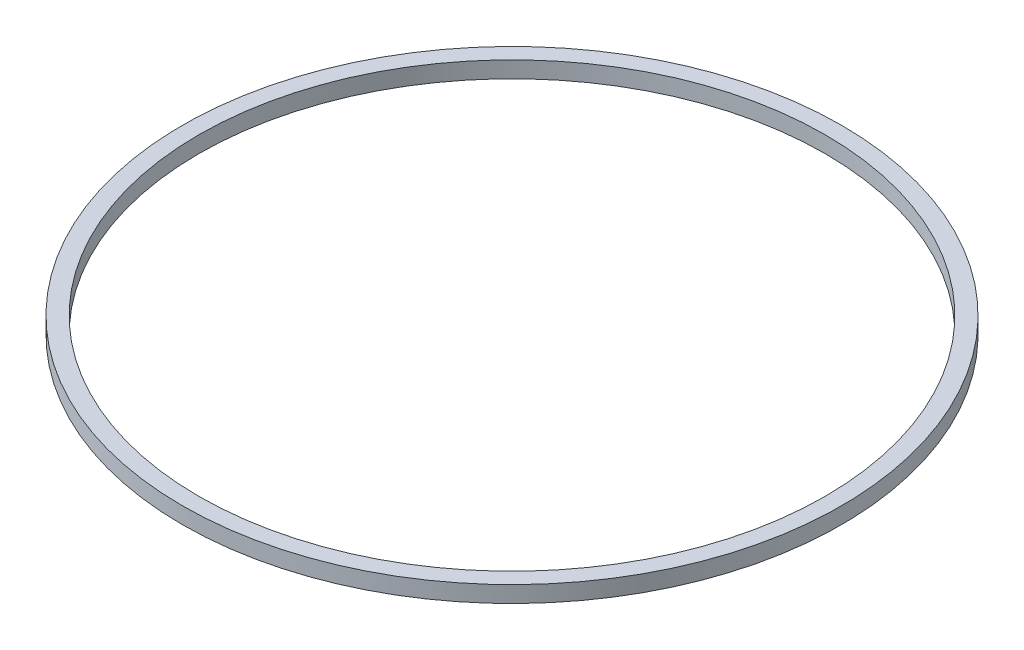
ISO-10303-21;
HEADER;
FILE_DESCRIPTION(('STEP AP214'),'2;1');
FILE_NAME('part.step','',(''),(''),'','','');
FILE_SCHEMA(('AUTOMOTIVE_DESIGN { 1 0 10303 214 1 1 1 1 }'));
ENDSEC;
DATA;
#1=APPLICATION_CONTEXT('core data for automotive mechanical design processes');
#2=APPLICATION_PROTOCOL_DEFINITION('international standard','automotive_design',2000,#1);
#3=PRODUCT_CONTEXT('',#1,'mechanical');
#4=PRODUCT('Part','Part','',(#3));
#5=PRODUCT_RELATED_PRODUCT_CATEGORY('part','',(#4));
#6=PRODUCT_DEFINITION_FORMATION('','',#4);
#7=PRODUCT_DEFINITION_CONTEXT('part definition',#1,'design');
#8=PRODUCT_DEFINITION('design','',#6,#7);
#9=PRODUCT_DEFINITION_SHAPE('','',#8);
#10=(LENGTH_UNIT() NAMED_UNIT(*) SI_UNIT(.MILLI.,.METRE.));
#11=(NAMED_UNIT(*) PLANE_ANGLE_UNIT() SI_UNIT($,.RADIAN.));
#12=(NAMED_UNIT(*) SI_UNIT($,.STERADIAN.) SOLID_ANGLE_UNIT());
#13=UNCERTAINTY_MEASURE_WITH_UNIT(LENGTH_MEASURE(1.E-05),#10,'distance_accuracy_value','');
#14=(GEOMETRIC_REPRESENTATION_CONTEXT(3) GLOBAL_UNCERTAINTY_ASSIGNED_CONTEXT((#13)) GLOBAL_UNIT_ASSIGNED_CONTEXT((#10,
#11,#12)) REPRESENTATION_CONTEXT('',''));
#15=CARTESIAN_POINT('',(0.,0.,0.));
#16=DIRECTION('',(0.,0.,1.));
#17=DIRECTION('',(1.,0.,0.));
#18=AXIS2_PLACEMENT_3D('',#15,#16,#17);
#19=CARTESIAN_POINT('',(0.,4.,0.));
#20=DIRECTION('',(0.,1.,0.));
#21=DIRECTION('',(0.,0.,1.));
#22=AXIS2_PLACEMENT_3D('',#19,#20,#21);
#23=PLANE('',#22);
#24=CARTESIAN_POINT('',(0.,4.,0.));
#25=DIRECTION('',(0.,1.,0.));
#26=DIRECTION('',(0.,0.,1.));
#27=AXIS2_PLACEMENT_3D('',#24,#25,#26);
#28=CIRCLE('',#27,80.4);
#29=CARTESIAN_POINT('',(0.,4.,80.4));
#30=VERTEX_POINT('',#29);
#31=EDGE_CURVE('E10',#30,#30,#28,.T.);
#32=ORIENTED_EDGE('',*,*,#31,.T.);
#33=EDGE_LOOP('',(#32));
#34=FACE_BOUND('',#33,.T.);
#35=CARTESIAN_POINT('',(0.,4.,0.));
#36=DIRECTION('',(0.,1.,0.));
#37=DIRECTION('',(0.,0.,1.));
#38=AXIS2_PLACEMENT_3D('',#35,#36,#37);
#39=CIRCLE('',#38,76.4);
#40=CARTESIAN_POINT('',(0.,4.,76.4));
#41=VERTEX_POINT('',#40);
#42=EDGE_CURVE('E46',#41,#41,#39,.T.);
#43=ORIENTED_EDGE('',*,*,#42,.F.);
#44=EDGE_LOOP('',(#43));
#45=FACE_BOUND('',#44,.T.);
#46=ADVANCED_FACE('F35',(#34,#45),#23,.T.);
#47=CARTESIAN_POINT('',(0.,0.,0.));
#48=DIRECTION('',(0.,1.,0.));
#49=DIRECTION('',(0.,0.,1.));
#50=AXIS2_PLACEMENT_3D('',#47,#48,#49);
#51=PLANE('',#50);
#52=CARTESIAN_POINT('',(0.,0.,0.));
#53=DIRECTION('',(0.,1.,0.));
#54=DIRECTION('',(0.,0.,1.));
#55=AXIS2_PLACEMENT_3D('',#52,#53,#54);
#56=CIRCLE('',#55,80.4);
#57=CARTESIAN_POINT('',(0.,0.,80.4));
#58=VERTEX_POINT('',#57);
#59=EDGE_CURVE('E39',#58,#58,#56,.T.);
#60=ORIENTED_EDGE('',*,*,#59,.F.);
#61=EDGE_LOOP('',(#60));
#62=FACE_BOUND('',#61,.T.);
#63=CARTESIAN_POINT('',(0.,0.,0.));
#64=DIRECTION('',(0.,1.,0.));
#65=DIRECTION('',(0.,0.,1.));
#66=AXIS2_PLACEMENT_3D('',#63,#64,#65);
#67=CIRCLE('',#66,76.4);
#68=CARTESIAN_POINT('',(0.,0.,76.4));
#69=VERTEX_POINT('',#68);
#70=EDGE_CURVE('E48',#69,#69,#67,.T.);
#71=ORIENTED_EDGE('',*,*,#70,.T.);
#72=EDGE_LOOP('',(#71));
#73=FACE_BOUND('',#72,.T.);
#74=ADVANCED_FACE('F58',(#62,#73),#51,.F.);
#75=CARTESIAN_POINT('',(0.,4.,0.));
#76=DIRECTION('',(0.,-1.,0.));
#77=DIRECTION('',(0.,0.,-1.));
#78=AXIS2_PLACEMENT_3D('',#75,#76,#77);
#79=CYLINDRICAL_SURFACE('',#78,80.4);
#80=ORIENTED_EDGE('',*,*,#31,.F.);
#81=EDGE_LOOP('',(#80));
#82=FACE_BOUND('',#81,.T.);
#83=ORIENTED_EDGE('',*,*,#59,.T.);
#84=EDGE_LOOP('',(#83));
#85=FACE_BOUND('',#84,.T.);
#86=ADVANCED_FACE('F37',(#82,#85),#79,.T.);
#87=CARTESIAN_POINT('',(0.,4.,0.));
#88=DIRECTION('',(0.,-1.,0.));
#89=DIRECTION('',(0.,0.,-1.));
#90=AXIS2_PLACEMENT_3D('',#87,#88,#89);
#91=CYLINDRICAL_SURFACE('',#90,76.4);
#92=ORIENTED_EDGE('',*,*,#42,.T.);
#93=EDGE_LOOP('',(#92));
#94=FACE_BOUND('',#93,.T.);
#95=ORIENTED_EDGE('',*,*,#70,.F.);
#96=EDGE_LOOP('',(#95));
#97=FACE_BOUND('',#96,.T.);
#98=ADVANCED_FACE('F54',(#94,#97),#91,.F.);
#99=CLOSED_SHELL('',(#46,#74,#86,#98));
#100=MANIFOLD_SOLID_BREP('B2',#99);
#101=ADVANCED_BREP_SHAPE_REPRESENTATION('',(#18,#100),#14);
#102=SHAPE_DEFINITION_REPRESENTATION(#9,#101);
ENDSEC;
END-ISO-10303-21;
